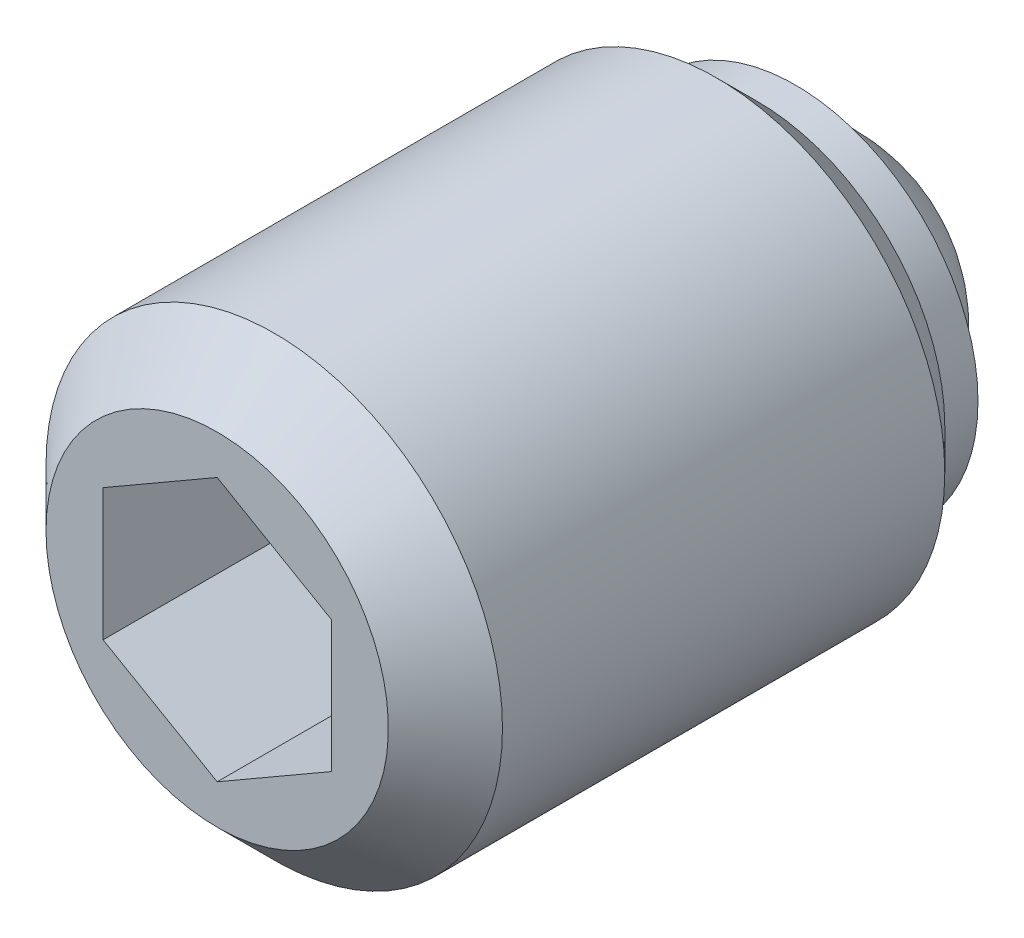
ISO-10303-21;
HEADER;
FILE_DESCRIPTION(('STEP AP214'),'2;1');
FILE_NAME('part.step','',(''),(''),'','','');
FILE_SCHEMA(('AUTOMOTIVE_DESIGN { 1 0 10303 214 1 1 1 1 }'));
ENDSEC;
DATA;
#1=APPLICATION_CONTEXT('core data for automotive mechanical design processes');
#2=APPLICATION_PROTOCOL_DEFINITION('international standard','automotive_design',2000,#1);
#3=PRODUCT_CONTEXT('',#1,'mechanical');
#4=PRODUCT('Part','Part','',(#3));
#5=PRODUCT_RELATED_PRODUCT_CATEGORY('part','',(#4));
#6=PRODUCT_DEFINITION_FORMATION('','',#4);
#7=PRODUCT_DEFINITION_CONTEXT('part definition',#1,'design');
#8=PRODUCT_DEFINITION('design','',#6,#7);
#9=PRODUCT_DEFINITION_SHAPE('','',#8);
#10=(LENGTH_UNIT() NAMED_UNIT(*) SI_UNIT(.MILLI.,.METRE.));
#11=(NAMED_UNIT(*) PLANE_ANGLE_UNIT() SI_UNIT($,.RADIAN.));
#12=(NAMED_UNIT(*) SI_UNIT($,.STERADIAN.) SOLID_ANGLE_UNIT());
#13=UNCERTAINTY_MEASURE_WITH_UNIT(LENGTH_MEASURE(1.E-05),#10,'distance_accuracy_value','');
#14=(GEOMETRIC_REPRESENTATION_CONTEXT(3) GLOBAL_UNCERTAINTY_ASSIGNED_CONTEXT((#13)) GLOBAL_UNIT_ASSIGNED_CONTEXT((#10,
#11,#12)) REPRESENTATION_CONTEXT('',''));
#15=CARTESIAN_POINT('',(0.,0.,0.));
#16=DIRECTION('',(0.,0.,1.));
#17=DIRECTION('',(1.,0.,0.));
#18=AXIS2_PLACEMENT_3D('',#15,#16,#17);
#19=CARTESIAN_POINT('',(0.,4.8,2.8));
#20=DIRECTION('',(0.,0.,1.));
#21=DIRECTION('',(1.,0.,0.));
#22=AXIS2_PLACEMENT_3D('',#19,#20,#21);
#23=PLANE('',#22);
#24=CARTESIAN_POINT('',(0.,0.,2.8));
#25=DIRECTION('',(0.,0.,1.));
#26=DIRECTION('',(1.,0.,0.));
#27=AXIS2_PLACEMENT_3D('',#24,#25,#26);
#28=CIRCLE('',#27,4.8);
#29=CARTESIAN_POINT('',(4.8,0.,2.8));
#30=VERTEX_POINT('',#29);
#31=EDGE_CURVE('E20',#30,#30,#28,.T.);
#32=ORIENTED_EDGE('',*,*,#31,.F.);
#33=EDGE_LOOP('',(#32));
#34=FACE_BOUND('',#33,.T.);
#35=CARTESIAN_POINT('',(3.99499687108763,0.,2.8));
#36=CARTESIAN_POINT('',(3.99498692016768,-0.224400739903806,2.8));
#37=CARTESIAN_POINT('',(3.97602639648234,-0.448964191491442,2.8));
#38=CARTESIAN_POINT('',(3.90065222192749,-0.8919064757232,2.8));
#39=CARTESIAN_POINT('',(3.84419349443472,-1.11027753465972,2.8));
#40=CARTESIAN_POINT('',(3.69543016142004,-1.53435385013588,2.8));
#41=CARTESIAN_POINT('',(3.60314267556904,-1.74006510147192,2.8));
#42=CARTESIAN_POINT('',(3.3853650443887,-2.1330163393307,2.8));
#43=CARTESIAN_POINT('',(3.25988315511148,-2.32026090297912,2.8));
#44=CARTESIAN_POINT('',(2.97925335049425,-2.67104911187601,2.8));
#45=CARTESIAN_POINT('',(2.82410233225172,-2.8345902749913,2.8));
#46=CARTESIAN_POINT('',(2.48854007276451,-3.13330974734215,2.8));
#47=CARTESIAN_POINT('',(2.30812784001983,-3.26848694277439,2.8));
#48=CARTESIAN_POINT('',(1.92717296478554,-3.50663129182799,2.8));
#49=CARTESIAN_POINT('',(1.72663069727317,-3.60959904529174,2.8));
#50=CARTESIAN_POINT('',(1.31110615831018,-3.78040466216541,2.8));
#51=CARTESIAN_POINT('',(1.09612391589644,-3.84824259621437,2.8));
#52=CARTESIAN_POINT('',(0.657821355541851,-3.94686330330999,2.8));
#53=CARTESIAN_POINT('',(0.434501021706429,-3.97764600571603,2.8));
#54=CARTESIAN_POINT('',(-0.01413750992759,-4.00128215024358,2.8));
#55=CARTESIAN_POINT('',(-0.239455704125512,-3.99413566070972,2.8));
#56=CARTESIAN_POINT('',(-0.685694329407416,-3.9421164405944,2.8));
#57=CARTESIAN_POINT('',(-0.906614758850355,-3.89724369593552,2.8));
#58=CARTESIAN_POINT('',(-1.33778672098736,-3.77104568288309,2.8));
#59=CARTESIAN_POINT('',(-1.548038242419,-3.68972037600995,2.8));
#60=CARTESIAN_POINT('',(-1.95190364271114,-3.4929258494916,2.8));
#61=CARTESIAN_POINT('',(-2.14551752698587,-3.37745664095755,2.8));
#62=CARTESIAN_POINT('',(-2.51061152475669,-3.11565218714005,2.8));
#63=CARTESIAN_POINT('',(-2.68209164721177,-2.96931695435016,2.8));
#64=CARTESIAN_POINT('',(-2.99805042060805,-2.64993442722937,2.8));
#65=CARTESIAN_POINT('',(-3.14252906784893,-2.47688712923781,2.8));
#66=CARTESIAN_POINT('',(-3.40038355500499,-2.1089927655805,2.8));
#67=CARTESIAN_POINT('',(-3.51375939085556,-1.91414569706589,2.8));
#68=CARTESIAN_POINT('',(-3.70618981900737,-1.50818295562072,2.8));
#69=CARTESIAN_POINT('',(-3.78524441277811,-1.29706728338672,2.8));
#70=CARTESIAN_POINT('',(-3.90678823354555,-0.864560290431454,2.8));
#71=CARTESIAN_POINT('',(-3.94927746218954,-0.643168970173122,2.8));
#72=CARTESIAN_POINT('',(-3.99648441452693,-0.196395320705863,2.8));
#73=CARTESIAN_POINT('',(-4.00120213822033,0.0289870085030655,2.8));
#74=CARTESIAN_POINT('',(-3.97273215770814,0.477344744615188,2.8));
#75=CARTESIAN_POINT('',(-3.93954445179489,0.700320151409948,2.8));
#76=CARTESIAN_POINT('',(-3.83620570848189,1.13753442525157,2.8));
#77=CARTESIAN_POINT('',(-3.76605466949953,1.35177329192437,2.8));
#78=CARTESIAN_POINT('',(-3.59078065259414,1.76543283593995,2.8));
#79=CARTESIAN_POINT('',(-3.48565767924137,1.96485351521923,2.8));
#80=CARTESIAN_POINT('',(-3.24342393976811,2.34321572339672,2.8));
#81=CARTESIAN_POINT('',(-3.1063131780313,2.52215725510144,2.8));
#82=CARTESIAN_POINT('',(-2.80399596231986,2.85448164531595,2.8));
#83=CARTESIAN_POINT('',(-2.63878949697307,3.00786449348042,2.8));
#84=CARTESIAN_POINT('',(-2.28497058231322,3.28471738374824,2.8));
#85=CARTESIAN_POINT('',(-2.09635812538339,3.4081874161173,2.8));
#86=CARTESIAN_POINT('',(-1.70108163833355,3.62170954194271,2.8));
#87=CARTESIAN_POINT('',(-1.49441762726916,3.71176167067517,2.8));
#88=CARTESIAN_POINT('',(-1.06890451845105,3.85589183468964,2.8));
#89=CARTESIAN_POINT('',(-0.850055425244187,3.90996988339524,2.8));
#90=CARTESIAN_POINT('',(-0.40638415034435,3.9806168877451,2.8));
#91=CARTESIAN_POINT('',(-0.181561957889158,3.99718577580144,2.8));
#92=CARTESIAN_POINT('',(0.267672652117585,3.99234393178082,2.8));
#93=CARTESIAN_POINT('',(0.492085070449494,3.97093327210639,2.8));
#94=CARTESIAN_POINT('',(0.934130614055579,3.89074013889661,2.8));
#95=CARTESIAN_POINT('',(1.15176372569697,3.83195759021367,2.8));
#96=CARTESIAN_POINT('',(1.57407614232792,3.67868798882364,2.8));
#97=CARTESIAN_POINT('',(1.77875520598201,3.58420027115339,2.8));
#98=CARTESIAN_POINT('',(2.16933700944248,3.36220655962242,2.8));
#99=CARTESIAN_POINT('',(2.35524048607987,3.23470186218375,2.8));
#100=CARTESIAN_POINT('',(2.70298474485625,2.95030885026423,2.8));
#101=CARTESIAN_POINT('',(2.86482804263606,2.7934236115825,2.8));
#102=CARTESIAN_POINT('',(3.15991972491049,2.45466311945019,2.8));
#103=CARTESIAN_POINT('',(3.29316099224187,2.27278166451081,2.8));
#104=CARTESIAN_POINT('',(3.52726722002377,1.88916007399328,2.8));
#105=CARTESIAN_POINT('',(3.62811669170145,1.68741049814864,2.8));
#106=CARTESIAN_POINT('',(3.79439717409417,1.27000190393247,2.8));
#107=CARTESIAN_POINT('',(3.85987064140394,1.0543599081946,2.8));
#108=CARTESIAN_POINT('',(3.93609042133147,0.697786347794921,2.8));
#109=CARTESIAN_POINT('',(3.95815277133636,0.55917171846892,2.8));
#110=CARTESIAN_POINT('',(3.98760910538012,0.280392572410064,2.8));
#111=CARTESIAN_POINT('',(3.99500308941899,0.140228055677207,2.8));
#112=CARTESIAN_POINT('',(3.99499687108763,0.,2.8));
#113=B_SPLINE_CURVE_WITH_KNOTS('',3,(#35,#36,#37,#38,#39,#40,#41,#42,#43,#44,#45,#46,#47,#48,
#49,#50,#51,#52,#53,#54,#55,#56,#57,#58,#59,#60,#61,#62,#63,#64,#65,#66,#67,#68,#69,#70,#71,#72,
#73,#74,#75,#76,#77,#78,#79,#80,#81,#82,#83,#84,#85,#86,#87,#88,#89,#90,#91,#92,#93,#94,#95,#96,
#97,#98,#99,#100,#101,#102,#103,#104,#105,#106,#107,#108,#109,#110,#111,#112),.UNSPECIFIED.,.T.,
.F.,(4,2,2,2,2,2,2,2,2,2,2,2,2,2,2,2,2,2,2,2,2,2,2,2,2,2,2,2,2,2,2,2,2,2,2,2,2,2,4),(0.,
0.672690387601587,1.34619088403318,2.0193699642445,2.69238176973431,3.36546399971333,
4.03857265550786,4.71166877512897,5.38476354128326,6.05785959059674,6.73095442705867,
7.40404951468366,8.07714531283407,8.75024089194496,9.42333619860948,10.0964315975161,
10.7695270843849,11.4426225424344,12.1157179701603,12.7888133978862,13.4619088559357,
14.1350043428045,14.8080997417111,15.4811950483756,16.1542906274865,16.8273864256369,
17.5004815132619,18.1735763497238,18.8466723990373,19.5197671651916,20.1928632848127,
20.8659719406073,21.5390541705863,22.2120659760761,22.8852450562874,23.558745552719,
24.2314359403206,24.6518002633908,25.072164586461),.UNSPECIFIED.);
#114=CARTESIAN_POINT('',(3.99499687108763,0.,2.8));
#115=VERTEX_POINT('',#114);
#116=EDGE_CURVE('E76',#115,#115,#113,.T.);
#117=ORIENTED_EDGE('',*,*,#116,.F.);
#118=EDGE_LOOP('',(#117));
#119=FACE_BOUND('',#118,.T.);
#120=ADVANCED_FACE('F14',(#34,#119),#23,.F.);
#121=CARTESIAN_POINT('',(0.,0.,10.));
#122=DIRECTION('',(0.,0.,-1.));
#123=DIRECTION('',(-1.,0.,0.));
#124=AXIS2_PLACEMENT_3D('',#121,#122,#123);
#125=PLANE('',#124);
#126=DIRECTION('',(0.,1.,0.));
#127=VECTOR('',#126,1.);
#128=CARTESIAN_POINT('',(-3.,-1.73205080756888,10.));
#129=LINE('',#128,#127);
#130=CARTESIAN_POINT('',(-3.,-1.73205080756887,10.));
#131=VERTEX_POINT('',#130);
#132=CARTESIAN_POINT('',(-3.,1.73205080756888,10.));
#133=VERTEX_POINT('',#132);
#134=EDGE_CURVE('E123',#131,#133,#129,.T.);
#135=ORIENTED_EDGE('',*,*,#134,.F.);
#136=DIRECTION('',(0.866025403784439,-0.5,0.));
#137=VECTOR('',#136,1.);
#138=CARTESIAN_POINT('',(0.,-3.46410161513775,10.));
#139=LINE('',#138,#137);
#140=CARTESIAN_POINT('',(0.,-3.46410161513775,10.));
#141=VERTEX_POINT('',#140);
#142=EDGE_CURVE('E119',#141,#131,#139,.F.);
#143=ORIENTED_EDGE('',*,*,#142,.F.);
#144=DIRECTION('',(-0.866025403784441,-0.5,0.));
#145=VECTOR('',#144,1.);
#146=CARTESIAN_POINT('',(1.5,-2.59807621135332,10.));
#147=LINE('',#146,#145);
#148=CARTESIAN_POINT('',(3.,-1.73205080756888,10.));
#149=VERTEX_POINT('',#148);
#150=EDGE_CURVE('E85',#149,#141,#147,.T.);
#151=ORIENTED_EDGE('',*,*,#150,.F.);
#152=DIRECTION('',(0.,1.,0.));
#153=VECTOR('',#152,1.);
#154=CARTESIAN_POINT('',(3.,0.,10.));
#155=LINE('',#154,#153);
#156=CARTESIAN_POINT('',(3.,1.73205080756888,10.));
#157=VERTEX_POINT('',#156);
#158=EDGE_CURVE('E68',#157,#149,#155,.F.);
#159=ORIENTED_EDGE('',*,*,#158,.F.);
#160=DIRECTION('',(0.866025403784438,-0.5,0.));
#161=VECTOR('',#160,1.);
#162=CARTESIAN_POINT('',(1.5,2.59807621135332,10.));
#163=LINE('',#162,#161);
#164=CARTESIAN_POINT('',(0.,3.46410161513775,10.));
#165=VERTEX_POINT('',#164);
#166=EDGE_CURVE('E71',#165,#157,#163,.T.);
#167=ORIENTED_EDGE('',*,*,#166,.F.);
#168=DIRECTION('',(0.866025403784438,0.5,0.));
#169=VECTOR('',#168,1.);
#170=CARTESIAN_POINT('',(-3.,1.73205080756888,10.));
#171=LINE('',#170,#169);
#172=EDGE_CURVE('E74',#133,#165,#171,.T.);
#173=ORIENTED_EDGE('',*,*,#172,.F.);
#174=EDGE_LOOP('',(#135,#143,#151,#159,#167,#173));
#175=FACE_BOUND('',#174,.T.);
#176=ADVANCED_FACE('F73',(#175),#125,.F.);
#177=CARTESIAN_POINT('',(0.,0.,2.8));
#178=DIRECTION('',(0.,0.,1.));
#179=DIRECTION('',(1.,0.,0.));
#180=AXIS2_PLACEMENT_3D('',#177,#178,#179);
#181=CYLINDRICAL_SURFACE('',#180,4.8);
#182=CARTESIAN_POINT('',(0.,0.,3.8));
#183=DIRECTION('',(0.,0.,1.));
#184=DIRECTION('',(1.,0.,0.));
#185=AXIS2_PLACEMENT_3D('',#182,#183,#184);
#186=CIRCLE('',#185,4.8);
#187=CARTESIAN_POINT('',(4.8,0.,3.8));
#188=VERTEX_POINT('',#187);
#189=EDGE_CURVE('E88',#188,#188,#186,.F.);
#190=ORIENTED_EDGE('',*,*,#189,.T.);
#191=EDGE_LOOP('',(#190));
#192=FACE_BOUND('',#191,.T.);
#193=ORIENTED_EDGE('',*,*,#31,.T.);
#194=EDGE_LOOP('',(#193));
#195=FACE_BOUND('',#194,.T.);
#196=ADVANCED_FACE('F264',(#192,#195),#181,.T.);
#197=CARTESIAN_POINT('',(-3.,-1.73205080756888,10.));
#198=DIRECTION('',(1.,0.,0.));
#199=DIRECTION('',(0.,0.,-1.));
#200=AXIS2_PLACEMENT_3D('',#197,#198,#199);
#201=PLANE('',#200);
#202=ORIENTED_EDGE('',*,*,#134,.T.);
#203=DIRECTION('',(0.,0.,-1.));
#204=VECTOR('',#203,1.);
#205=CARTESIAN_POINT('',(-3.,1.73205080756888,10.));
#206=LINE('',#205,#204);
#207=CARTESIAN_POINT('',(-3.,1.73205080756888,18.));
#208=VERTEX_POINT('',#207);
#209=EDGE_CURVE('E84',#208,#133,#206,.T.);
#210=ORIENTED_EDGE('',*,*,#209,.F.);
#211=DIRECTION('',(0.,1.,0.));
#212=VECTOR('',#211,1.);
#213=CARTESIAN_POINT('',(-3.,0.,18.));
#214=LINE('',#213,#212);
#215=CARTESIAN_POINT('',(-3.,-1.73205080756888,18.));
#216=VERTEX_POINT('',#215);
#217=EDGE_CURVE('E91',#208,#216,#214,.F.);
#218=ORIENTED_EDGE('',*,*,#217,.T.);
#219=DIRECTION('',(0.,0.,-1.));
#220=VECTOR('',#219,1.);
#221=CARTESIAN_POINT('',(-3.,-1.73205080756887,10.));
#222=LINE('',#221,#220);
#223=EDGE_CURVE('E122',#131,#216,#222,.F.);
#224=ORIENTED_EDGE('',*,*,#223,.F.);
#225=EDGE_LOOP('',(#202,#210,#218,#224));
#226=FACE_BOUND('',#225,.T.);
#227=ADVANCED_FACE('F145',(#226),#201,.T.);
#228=CARTESIAN_POINT('',(0.,-3.46410161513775,10.));
#229=DIRECTION('',(0.5,0.866025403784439,0.));
#230=DIRECTION('',(0.866025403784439,-0.5,0.));
#231=AXIS2_PLACEMENT_3D('',#228,#229,#230);
#232=PLANE('',#231);
#233=ORIENTED_EDGE('',*,*,#142,.T.);
#234=ORIENTED_EDGE('',*,*,#223,.T.);
#235=DIRECTION('',(0.86602540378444,-0.5,0.));
#236=VECTOR('',#235,1.);
#237=CARTESIAN_POINT('',(-3.,-1.73205080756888,18.));
#238=LINE('',#237,#236);
#239=CARTESIAN_POINT('',(0.,-3.46410161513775,18.));
#240=VERTEX_POINT('',#239);
#241=EDGE_CURVE('E116',#216,#240,#238,.T.);
#242=ORIENTED_EDGE('',*,*,#241,.T.);
#243=DIRECTION('',(0.,0.,-1.));
#244=VECTOR('',#243,1.);
#245=CARTESIAN_POINT('',(0.,-3.46410161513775,10.));
#246=LINE('',#245,#244);
#247=EDGE_CURVE('E126',#141,#240,#246,.F.);
#248=ORIENTED_EDGE('',*,*,#247,.F.);
#249=EDGE_LOOP('',(#233,#234,#242,#248));
#250=FACE_BOUND('',#249,.T.);
#251=ADVANCED_FACE('F147',(#250),#232,.T.);
#252=CARTESIAN_POINT('',(3.,-1.73205080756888,10.));
#253=DIRECTION('',(-0.5,0.866025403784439,0.));
#254=DIRECTION('',(0.866025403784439,0.5,0.));
#255=AXIS2_PLACEMENT_3D('',#252,#253,#254);
#256=PLANE('',#255);
#257=ORIENTED_EDGE('',*,*,#150,.T.);
#258=ORIENTED_EDGE('',*,*,#247,.T.);
#259=DIRECTION('',(0.86602540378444,0.5,0.));
#260=VECTOR('',#259,1.);
#261=CARTESIAN_POINT('',(0.,-3.46410161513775,18.));
#262=LINE('',#261,#260);
#263=CARTESIAN_POINT('',(3.,-1.73205080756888,18.));
#264=VERTEX_POINT('',#263);
#265=EDGE_CURVE('E114',#240,#264,#262,.T.);
#266=ORIENTED_EDGE('',*,*,#265,.T.);
#267=DIRECTION('',(0.,0.,1.));
#268=VECTOR('',#267,1.);
#269=CARTESIAN_POINT('',(3.,-1.73205080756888,10.));
#270=LINE('',#269,#268);
#271=EDGE_CURVE('E133',#149,#264,#270,.T.);
#272=ORIENTED_EDGE('',*,*,#271,.F.);
#273=EDGE_LOOP('',(#257,#258,#266,#272));
#274=FACE_BOUND('',#273,.T.);
#275=ADVANCED_FACE('F150',(#274),#256,.T.);
#276=CARTESIAN_POINT('',(3.,1.73205080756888,10.));
#277=DIRECTION('',(-1.,0.,0.));
#278=DIRECTION('',(0.,0.,1.));
#279=AXIS2_PLACEMENT_3D('',#276,#277,#278);
#280=PLANE('',#279);
#281=ORIENTED_EDGE('',*,*,#158,.T.);
#282=ORIENTED_EDGE('',*,*,#271,.T.);
#283=DIRECTION('',(0.,1.,0.));
#284=VECTOR('',#283,1.);
#285=CARTESIAN_POINT('',(3.,0.,18.));
#286=LINE('',#285,#284);
#287=CARTESIAN_POINT('',(3.,1.73205080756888,18.));
#288=VERTEX_POINT('',#287);
#289=EDGE_CURVE('E107',#264,#288,#286,.T.);
#290=ORIENTED_EDGE('',*,*,#289,.T.);
#291=DIRECTION('',(0.,0.,-1.));
#292=VECTOR('',#291,1.);
#293=CARTESIAN_POINT('',(3.,1.73205080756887,10.));
#294=LINE('',#293,#292);
#295=EDGE_CURVE('E92',#157,#288,#294,.F.);
#296=ORIENTED_EDGE('',*,*,#295,.F.);
#297=EDGE_LOOP('',(#281,#282,#290,#296));
#298=FACE_BOUND('',#297,.T.);
#299=ADVANCED_FACE('F152',(#298),#280,.T.);
#300=CARTESIAN_POINT('',(0.,3.46410161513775,10.));
#301=DIRECTION('',(-0.5,-0.866025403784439,0.));
#302=DIRECTION('',(-0.866025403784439,0.5,0.));
#303=AXIS2_PLACEMENT_3D('',#300,#301,#302);
#304=PLANE('',#303);
#305=ORIENTED_EDGE('',*,*,#166,.T.);
#306=ORIENTED_EDGE('',*,*,#295,.T.);
#307=DIRECTION('',(-0.86602540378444,0.5,0.));
#308=VECTOR('',#307,1.);
#309=CARTESIAN_POINT('',(3.,1.73205080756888,18.));
#310=LINE('',#309,#308);
#311=CARTESIAN_POINT('',(0.,3.46410161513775,18.));
#312=VERTEX_POINT('',#311);
#313=EDGE_CURVE('E35',#288,#312,#310,.T.);
#314=ORIENTED_EDGE('',*,*,#313,.T.);
#315=DIRECTION('',(0.,0.,-1.));
#316=VECTOR('',#315,1.);
#317=CARTESIAN_POINT('',(0.,3.46410161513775,10.));
#318=LINE('',#317,#316);
#319=EDGE_CURVE('E82',#165,#312,#318,.F.);
#320=ORIENTED_EDGE('',*,*,#319,.F.);
#321=EDGE_LOOP('',(#305,#306,#314,#320));
#322=FACE_BOUND('',#321,.T.);
#323=ADVANCED_FACE('F87',(#322),#304,.T.);
#324=CARTESIAN_POINT('',(-3.,1.73205080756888,10.));
#325=DIRECTION('',(0.5,-0.866025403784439,0.));
#326=DIRECTION('',(-0.866025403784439,-0.5,0.));
#327=AXIS2_PLACEMENT_3D('',#324,#325,#326);
#328=PLANE('',#327);
#329=ORIENTED_EDGE('',*,*,#172,.T.);
#330=ORIENTED_EDGE('',*,*,#319,.T.);
#331=DIRECTION('',(-0.86602540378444,-0.5,0.));
#332=VECTOR('',#331,1.);
#333=CARTESIAN_POINT('',(0.,3.46410161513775,18.));
#334=LINE('',#333,#332);
#335=EDGE_CURVE('E102',#312,#208,#334,.T.);
#336=ORIENTED_EDGE('',*,*,#335,.T.);
#337=ORIENTED_EDGE('',*,*,#209,.T.);
#338=EDGE_LOOP('',(#329,#330,#336,#337));
#339=FACE_BOUND('',#338,.T.);
#340=ADVANCED_FACE('F80',(#339),#328,.T.);
#341=CARTESIAN_POINT('',(0.,4.9265,3.8));
#342=DIRECTION('',(0.,0.,1.));
#343=DIRECTION('',(1.,0.,0.));
#344=AXIS2_PLACEMENT_3D('',#341,#342,#343);
#345=PLANE('',#344);
#346=CARTESIAN_POINT('',(0.,0.,3.8000000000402));
#347=DIRECTION('',(0.,0.,1.));
#348=DIRECTION('',(1.,0.,0.));
#349=AXIS2_PLACEMENT_3D('',#346,#347,#348);
#350=CIRCLE('',#349,4.92649999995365);
#351=CARTESIAN_POINT('',(4.92649999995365,0.,3.8000000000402));
#352=VERTEX_POINT('',#351);
#353=EDGE_CURVE('E100',#352,#352,#350,.T.);
#354=ORIENTED_EDGE('',*,*,#353,.F.);
#355=EDGE_LOOP('',(#354));
#356=FACE_BOUND('',#355,.T.);
#357=ORIENTED_EDGE('',*,*,#189,.F.);
#358=EDGE_LOOP('',(#357));
#359=FACE_BOUND('',#358,.T.);
#360=ADVANCED_FACE('F183',(#356,#359),#345,.F.);
#361=CARTESIAN_POINT('',(0.,0.,18.));
#362=DIRECTION('',(0.,0.,-1.));
#363=DIRECTION('',(-1.,0.,0.));
#364=AXIS2_PLACEMENT_3D('',#361,#362,#363);
#365=PLANE('',#364);
#366=ORIENTED_EDGE('',*,*,#313,.F.);
#367=ORIENTED_EDGE('',*,*,#289,.F.);
#368=ORIENTED_EDGE('',*,*,#265,.F.);
#369=ORIENTED_EDGE('',*,*,#241,.F.);
#370=ORIENTED_EDGE('',*,*,#217,.F.);
#371=ORIENTED_EDGE('',*,*,#335,.F.);
#372=EDGE_LOOP('',(#366,#367,#368,#369,#370,#371));
#373=FACE_BOUND('',#372,.T.);
#374=CARTESIAN_POINT('',(0.,0.,18.));
#375=DIRECTION('',(0.,0.,-1.));
#376=DIRECTION('',(-1.,0.,0.));
#377=AXIS2_PLACEMENT_3D('',#374,#375,#376);
#378=CIRCLE('',#377,4.50000000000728);
#379=CARTESIAN_POINT('',(-4.50000000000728,0.,18.));
#380=VERTEX_POINT('',#379);
#381=EDGE_CURVE('E97',#380,#380,#378,.T.);
#382=ORIENTED_EDGE('',*,*,#381,.F.);
#383=EDGE_LOOP('',(#382));
#384=FACE_BOUND('',#383,.T.);
#385=ADVANCED_FACE('F139',(#373,#384),#365,.F.);
#386=CARTESIAN_POINT('',(0.,0.,4.87350000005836));
#387=DIRECTION('',(0.,0.,1.));
#388=DIRECTION('',(1.,0.,0.));
#389=AXIS2_PLACEMENT_3D('',#386,#387,#388);
#390=CONICAL_SURFACE('',#389,5.99999999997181,0.785398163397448);
#391=CARTESIAN_POINT('',(0.,0.,4.8735));
#392=DIRECTION('',(0.,0.,1.));
#393=DIRECTION('',(1.,0.,0.));
#394=AXIS2_PLACEMENT_3D('',#391,#392,#393);
#395=CIRCLE('',#394,6.);
#396=CARTESIAN_POINT('',(6.,0.,4.8735));
#397=VERTEX_POINT('',#396);
#398=EDGE_CURVE('E26',#397,#397,#395,.T.);
#399=ORIENTED_EDGE('',*,*,#398,.F.);
#400=EDGE_LOOP('',(#399));
#401=FACE_BOUND('',#400,.T.);
#402=ORIENTED_EDGE('',*,*,#353,.T.);
#403=EDGE_LOOP('',(#402));
#404=FACE_BOUND('',#403,.T.);
#405=ADVANCED_FACE('F171',(#401,#404),#390,.T.);
#406=CARTESIAN_POINT('',(0.,0.,16.4999999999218));
#407=DIRECTION('',(0.,0.,-1.));
#408=DIRECTION('',(-1.,0.,0.));
#409=AXIS2_PLACEMENT_3D('',#406,#407,#408);
#410=CONICAL_SURFACE('',#409,6.00000000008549,0.785398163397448);
#411=ORIENTED_EDGE('',*,*,#381,.T.);
#412=EDGE_LOOP('',(#411));
#413=FACE_BOUND('',#412,.T.);
#414=CARTESIAN_POINT('',(0.,0.,16.5));
#415=DIRECTION('',(0.,0.,1.));
#416=DIRECTION('',(1.,0.,0.));
#417=AXIS2_PLACEMENT_3D('',#414,#415,#416);
#418=CIRCLE('',#417,6.);
#419=CARTESIAN_POINT('',(6.,0.,16.5));
#420=VERTEX_POINT('',#419);
#421=EDGE_CURVE('E9',#420,#420,#418,.F.);
#422=ORIENTED_EDGE('',*,*,#421,.F.);
#423=EDGE_LOOP('',(#422));
#424=FACE_BOUND('',#423,.T.);
#425=ADVANCED_FACE('F163',(#413,#424),#410,.T.);
#426=CARTESIAN_POINT('',(0.,0.,2.8));
#427=DIRECTION('',(0.,0.,1.));
#428=DIRECTION('',(1.,0.,0.));
#429=AXIS2_PLACEMENT_3D('',#426,#427,#428);
#430=CYLINDRICAL_SURFACE('',#429,6.);
#431=ORIENTED_EDGE('',*,*,#421,.T.);
#432=EDGE_LOOP('',(#431));
#433=FACE_BOUND('',#432,.T.);
#434=ORIENTED_EDGE('',*,*,#398,.T.);
#435=EDGE_LOOP('',(#434));
#436=FACE_BOUND('',#435,.T.);
#437=ADVANCED_FACE('F161',(#433,#436),#430,.T.);
#438=CARTESIAN_POINT('',(0.,0.,4.25));
#439=DIRECTION('',(-1.,0.,0.));
#440=DIRECTION('',(0.,0.,1.));
#441=AXIS2_PLACEMENT_3D('',#438,#439,#440);
#442=SPHERICAL_SURFACE('',#441,4.25);
#443=ORIENTED_EDGE('',*,*,#116,.T.);
#444=EDGE_LOOP('',(#443));
#445=FACE_BOUND('',#444,.T.);
#446=ADVANCED_FACE('F16',(#445),#442,.T.);
#447=CLOSED_SHELL('',(#120,#176,#196,#227,#251,#275,#299,#323,#340,#360,#385,#405,#425,#437,#446));
#448=MANIFOLD_SOLID_BREP('B1',#447);
#449=ADVANCED_BREP_SHAPE_REPRESENTATION('',(#18,#448),#14);
#450=SHAPE_DEFINITION_REPRESENTATION(#9,#449);
ENDSEC;
END-ISO-10303-21;
